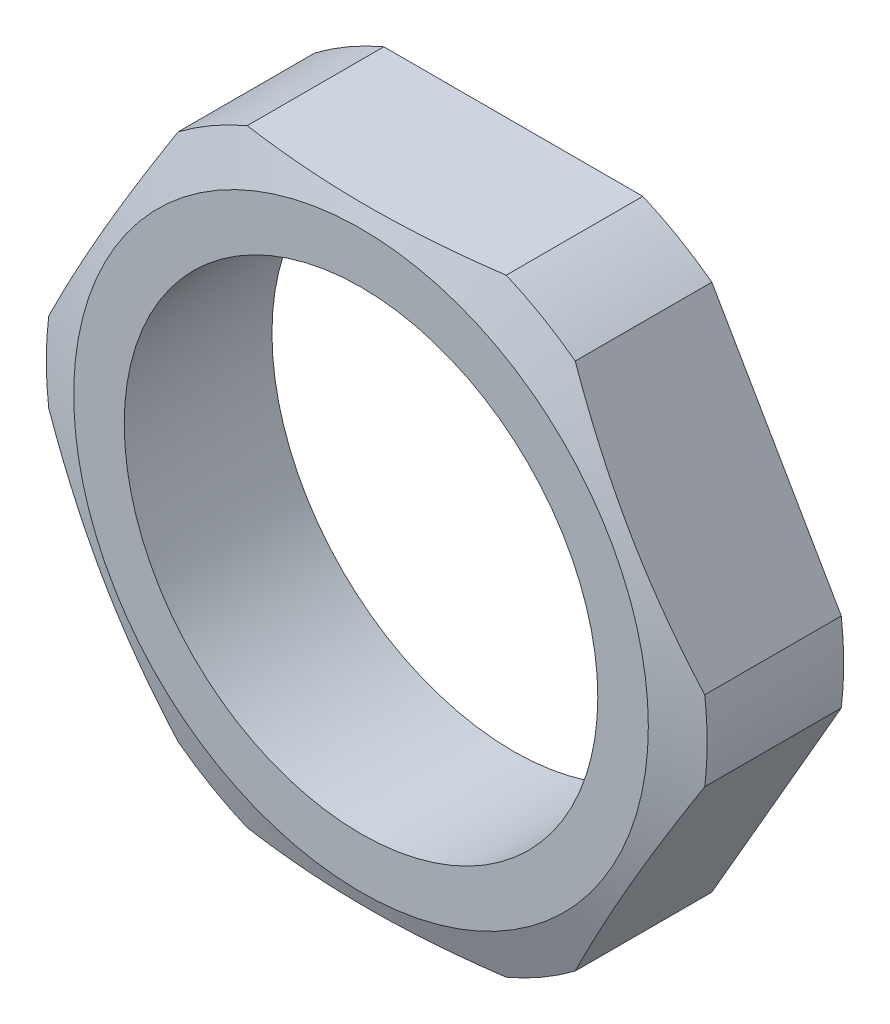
ISO-10303-21;
HEADER;
FILE_DESCRIPTION(('STEP AP214'),'2;1');
FILE_NAME('part.step','',(''),(''),'','','');
FILE_SCHEMA(('AUTOMOTIVE_DESIGN { 1 0 10303 214 1 1 1 1 }'));
ENDSEC;
DATA;
#1=APPLICATION_CONTEXT('core data for automotive mechanical design processes');
#2=APPLICATION_PROTOCOL_DEFINITION('international standard','automotive_design',2000,#1);
#3=PRODUCT_CONTEXT('',#1,'mechanical');
#4=PRODUCT('Part','Part','',(#3));
#5=PRODUCT_RELATED_PRODUCT_CATEGORY('part','',(#4));
#6=PRODUCT_DEFINITION_FORMATION('','',#4);
#7=PRODUCT_DEFINITION_CONTEXT('part definition',#1,'design');
#8=PRODUCT_DEFINITION('design','',#6,#7);
#9=PRODUCT_DEFINITION_SHAPE('','',#8);
#10=(LENGTH_UNIT() NAMED_UNIT(*) SI_UNIT(.MILLI.,.METRE.));
#11=(NAMED_UNIT(*) PLANE_ANGLE_UNIT() SI_UNIT($,.RADIAN.));
#12=(NAMED_UNIT(*) SI_UNIT($,.STERADIAN.) SOLID_ANGLE_UNIT());
#13=UNCERTAINTY_MEASURE_WITH_UNIT(LENGTH_MEASURE(1.E-05),#10,'distance_accuracy_value','');
#14=(GEOMETRIC_REPRESENTATION_CONTEXT(3) GLOBAL_UNCERTAINTY_ASSIGNED_CONTEXT((#13)) GLOBAL_UNIT_ASSIGNED_CONTEXT((#10,
#11,#12)) REPRESENTATION_CONTEXT('',''));
#15=CARTESIAN_POINT('',(0.,0.,0.));
#16=DIRECTION('',(0.,0.,1.));
#17=DIRECTION('',(1.,0.,0.));
#18=AXIS2_PLACEMENT_3D('',#15,#16,#17);
#19=CARTESIAN_POINT('',(7.75762462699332,-13.4366,3.3655));
#20=DIRECTION('',(-0.866025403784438,0.5,0.));
#21=DIRECTION('',(-0.5,-0.866025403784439,0.));
#22=AXIS2_PLACEMENT_3D('',#19,#20,#21);
#23=PLANE('',#22);
#24=DIRECTION('',(0.,0.,1.));
#25=VECTOR('',#24,1.);
#26=CARTESIAN_POINT('',(8.77445312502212,-11.6754013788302,-3.3655));
#27=LINE('',#26,#25);
#28=CARTESIAN_POINT('',(8.77445312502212,-11.6754013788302,-3.3655));
#29=VERTEX_POINT('',#28);
#30=CARTESIAN_POINT('',(8.77445312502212,-11.6754013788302,2.67213670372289));
#31=VERTEX_POINT('',#30);
#32=EDGE_CURVE('E188',#29,#31,#27,.T.);
#33=ORIENTED_EDGE('',*,*,#32,.F.);
#34=DIRECTION('',(0.5,0.866025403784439,0.));
#35=VECTOR('',#34,1.);
#36=CARTESIAN_POINT('',(7.75762462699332,-13.4366,-3.3655));
#37=LINE('',#36,#35);
#38=CARTESIAN_POINT('',(14.4984207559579,-1.76119862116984,-3.3655));
#39=VERTEX_POINT('',#38);
#40=EDGE_CURVE('E147',#29,#39,#37,.T.);
#41=ORIENTED_EDGE('',*,*,#40,.T.);
#42=DIRECTION('',(0.,0.,1.));
#43=VECTOR('',#42,1.);
#44=CARTESIAN_POINT('',(14.4984207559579,-1.76119862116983,-3.3655));
#45=LINE('',#44,#43);
#46=CARTESIAN_POINT('',(14.4984207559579,-1.76119862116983,2.67213670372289));
#47=VERTEX_POINT('',#46);
#48=EDGE_CURVE('E125',#47,#39,#45,.F.);
#49=ORIENTED_EDGE('',*,*,#48,.F.);
#50=CARTESIAN_POINT('',(7.75750915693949,-13.4368,2.34079104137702));
#51=CARTESIAN_POINT('',(8.07877898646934,-12.8803443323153,2.45776475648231));
#52=CARTESIAN_POINT('',(8.40110819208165,-12.3220537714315,2.5641723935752));
#53=CARTESIAN_POINT('',(9.04786232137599,-11.2018427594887,2.7513799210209));
#54=CARTESIAN_POINT('',(9.37228868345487,-10.6399198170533,2.83215977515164));
#55=CARTESIAN_POINT('',(10.0196369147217,-9.51867979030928,2.96281878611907));
#56=CARTESIAN_POINT('',(10.3425440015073,-8.95938830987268,3.0129829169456));
#57=CARTESIAN_POINT('',(10.9891132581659,-7.83949750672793,3.08026709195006));
#58=CARTESIAN_POINT('',(11.3127750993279,-7.27889875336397,3.09739952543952));
#59=CARTESIAN_POINT('',(11.960098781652,-6.15770124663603,3.09739952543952));
#60=CARTESIAN_POINT('',(12.2837606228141,-5.59710249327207,3.08026709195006));
#61=CARTESIAN_POINT('',(12.9303298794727,-4.47721169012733,3.0129829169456));
#62=CARTESIAN_POINT('',(13.2532369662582,-3.91792020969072,2.96281878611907));
#63=CARTESIAN_POINT('',(13.9005851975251,-2.79668018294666,2.83215977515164));
#64=CARTESIAN_POINT('',(14.225011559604,-2.2347572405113,2.7513799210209));
#65=CARTESIAN_POINT('',(14.8717656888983,-1.11454622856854,2.5641723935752));
#66=CARTESIAN_POINT('',(15.1940948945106,-0.556255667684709,2.45776475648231));
#67=CARTESIAN_POINT('',(15.5153647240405,0.000200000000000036,2.34079104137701));
#68=B_SPLINE_CURVE_WITH_KNOTS('',3,(#50,#51,#52,#53,#54,#55,#56,#57,#58,#59,#60,#61,#62,#63,#64,
#65,#66,#67),.UNSPECIFIED.,.F.,.F.,(4,2,2,2,2,2,2,2,4),(0.,1.95950312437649,3.92053446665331,
5.8630222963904,7.80478140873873,9.74654052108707,11.6890283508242,13.650059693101,
15.6095628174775),.UNSPECIFIED.);
#69=EDGE_CURVE('E182',#31,#47,#68,.T.);
#70=ORIENTED_EDGE('',*,*,#69,.F.);
#71=EDGE_LOOP('',(#33,#41,#49,#70));
#72=FACE_BOUND('',#71,.T.);
#73=ADVANCED_FACE('F31',(#72),#23,.F.);
#74=CARTESIAN_POINT('',(15.5152492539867,0.,3.3655));
#75=DIRECTION('',(-0.866025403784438,-0.5,0.));
#76=DIRECTION('',(0.5,-0.866025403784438,0.));
#77=AXIS2_PLACEMENT_3D('',#74,#75,#76);
#78=PLANE('',#77);
#79=DIRECTION('',(0.,0.,1.));
#80=VECTOR('',#79,1.);
#81=CARTESIAN_POINT('',(14.4984207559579,1.76119862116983,-3.3655));
#82=LINE('',#81,#80);
#83=CARTESIAN_POINT('',(14.4984207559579,1.76119862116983,-3.3655));
#84=VERTEX_POINT('',#83);
#85=CARTESIAN_POINT('',(14.4984207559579,1.76119862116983,2.67213670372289));
#86=VERTEX_POINT('',#85);
#87=EDGE_CURVE('E122',#84,#86,#82,.T.);
#88=ORIENTED_EDGE('',*,*,#87,.F.);
#89=DIRECTION('',(-0.5,0.866025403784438,0.));
#90=VECTOR('',#89,1.);
#91=CARTESIAN_POINT('',(15.5152492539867,0.,-3.3655));
#92=LINE('',#91,#90);
#93=CARTESIAN_POINT('',(8.77445312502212,11.6754013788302,-3.3655));
#94=VERTEX_POINT('',#93);
#95=EDGE_CURVE('E138',#84,#94,#92,.T.);
#96=ORIENTED_EDGE('',*,*,#95,.T.);
#97=DIRECTION('',(0.,0.,1.));
#98=VECTOR('',#97,1.);
#99=CARTESIAN_POINT('',(8.77445312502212,11.6754013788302,-3.3655));
#100=LINE('',#99,#98);
#101=CARTESIAN_POINT('',(8.77445312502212,11.6754013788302,2.67213670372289));
#102=VERTEX_POINT('',#101);
#103=EDGE_CURVE('E141',#102,#94,#100,.F.);
#104=ORIENTED_EDGE('',*,*,#103,.F.);
#105=CARTESIAN_POINT('',(15.5153647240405,-0.000199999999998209,2.34079104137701));
#106=CARTESIAN_POINT('',(15.1940948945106,0.556255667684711,2.45776475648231));
#107=CARTESIAN_POINT('',(14.8717656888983,1.11454622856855,2.56417239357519));
#108=CARTESIAN_POINT('',(14.225011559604,2.2347572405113,2.7513799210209));
#109=CARTESIAN_POINT('',(13.9005851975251,2.79668018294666,2.83215977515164));
#110=CARTESIAN_POINT('',(13.2532369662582,3.91792020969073,2.96281878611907));
#111=CARTESIAN_POINT('',(12.9303298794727,4.47721169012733,3.0129829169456));
#112=CARTESIAN_POINT('',(12.2837606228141,5.59710249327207,3.08026709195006));
#113=CARTESIAN_POINT('',(11.960098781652,6.15770124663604,3.09739952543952));
#114=CARTESIAN_POINT('',(11.3127750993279,7.27889875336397,3.09739952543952));
#115=CARTESIAN_POINT('',(10.9891132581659,7.83949750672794,3.08026709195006));
#116=CARTESIAN_POINT('',(10.3425440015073,8.95938830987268,3.0129829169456));
#117=CARTESIAN_POINT('',(10.0196369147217,9.51867979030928,2.96281878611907));
#118=CARTESIAN_POINT('',(9.37228868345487,10.6399198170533,2.83215977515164));
#119=CARTESIAN_POINT('',(9.04786232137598,11.2018427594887,2.7513799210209));
#120=CARTESIAN_POINT('',(8.40110819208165,12.3220537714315,2.5641723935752));
#121=CARTESIAN_POINT('',(8.07877898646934,12.8803443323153,2.45776475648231));
#122=CARTESIAN_POINT('',(7.75750915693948,13.4368,2.34079104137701));
#123=B_SPLINE_CURVE_WITH_KNOTS('',3,(#105,#106,#107,#108,#109,#110,#111,#112,#113,#114,#115,
#116,#117,#118,#119,#120,#121,#122),.UNSPECIFIED.,.F.,.F.,(4,2,2,2,2,2,2,2,4),(0.,
1.95950312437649,3.92053446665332,5.8630222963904,7.80478140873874,9.74654052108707,
11.6890283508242,13.650059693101,15.6095628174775),.UNSPECIFIED.);
#124=EDGE_CURVE('E140',#86,#102,#123,.T.);
#125=ORIENTED_EDGE('',*,*,#124,.F.);
#126=EDGE_LOOP('',(#88,#96,#104,#125));
#127=FACE_BOUND('',#126,.T.);
#128=ADVANCED_FACE('F136',(#127),#78,.F.);
#129=CARTESIAN_POINT('',(7.75762462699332,13.4366,3.3655));
#130=DIRECTION('',(0.,-1.,0.));
#131=DIRECTION('',(1.,0.,0.));
#132=AXIS2_PLACEMENT_3D('',#129,#130,#131);
#133=PLANE('',#132);
#134=DIRECTION('',(0.,0.,1.));
#135=VECTOR('',#134,1.);
#136=CARTESIAN_POINT('',(5.72396763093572,13.4366,-3.3655));
#137=LINE('',#136,#135);
#138=CARTESIAN_POINT('',(5.72396763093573,13.4366,-3.3655));
#139=VERTEX_POINT('',#138);
#140=CARTESIAN_POINT('',(5.72396763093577,13.4366,2.67213670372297));
#141=VERTEX_POINT('',#140);
#142=EDGE_CURVE('E378',#139,#141,#137,.T.);
#143=ORIENTED_EDGE('',*,*,#142,.F.);
#144=DIRECTION('',(-1.,0.,0.));
#145=VECTOR('',#144,1.);
#146=CARTESIAN_POINT('',(7.75762462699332,13.4366,-3.3655));
#147=LINE('',#146,#145);
#148=CARTESIAN_POINT('',(-5.72396763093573,13.4366,-3.3655));
#149=VERTEX_POINT('',#148);
#150=EDGE_CURVE('E146',#139,#149,#147,.T.);
#151=ORIENTED_EDGE('',*,*,#150,.T.);
#152=DIRECTION('',(0.,0.,1.));
#153=VECTOR('',#152,1.);
#154=CARTESIAN_POINT('',(-5.72396763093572,13.4366,-3.3655));
#155=LINE('',#154,#153);
#156=CARTESIAN_POINT('',(-5.72396763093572,13.4366,2.67213670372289));
#157=VERTEX_POINT('',#156);
#158=EDGE_CURVE('E376',#157,#149,#155,.F.);
#159=ORIENTED_EDGE('',*,*,#158,.F.);
#160=CARTESIAN_POINT('',(-20.737507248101,13.4366,-1.00579964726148));
#161=CARTESIAN_POINT('',(-20.432218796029,13.4366,-0.912549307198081));
#162=CARTESIAN_POINT('',(-20.1267614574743,13.4366,-0.819852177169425));
#163=CARTESIAN_POINT('',(-19.5154743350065,13.4366,-0.635688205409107));
#164=CARTESIAN_POINT('',(-19.2096445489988,13.4366,-0.544221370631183));
#165=CARTESIAN_POINT('',(-18.2915057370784,13.4366,-0.27184064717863));
#166=CARTESIAN_POINT('',(-17.6785910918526,13.4366,-0.0929599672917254));
#167=CARTESIAN_POINT('',(-16.4497777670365,13.4366,0.25843615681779));
#168=CARTESIAN_POINT('',(-15.8338757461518,13.4366,0.430939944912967));
#169=CARTESIAN_POINT('',(-14.5998056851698,13.4366,0.767632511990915));
#170=CARTESIAN_POINT('',(-13.9816376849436,13.4366,0.931821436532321));
#171=CARTESIAN_POINT('',(-12.7511051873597,13.4366,1.24763783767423));
#172=CARTESIAN_POINT('',(-12.1387771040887,13.4366,1.39940651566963));
#173=CARTESIAN_POINT('',(-10.9110984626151,13.4366,1.6903199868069));
#174=CARTESIAN_POINT('',(-10.2957478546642,13.4366,1.82946457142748));
#175=CARTESIAN_POINT('',(-9.06182828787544,13.4366,2.09195868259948));
#176=CARTESIAN_POINT('',(-8.44326022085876,13.4366,2.21531236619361));
#177=CARTESIAN_POINT('',(-7.2025266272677,13.4366,2.4425230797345));
#178=CARTESIAN_POINT('',(-6.58036121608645,13.4366,2.54638073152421));
#179=CARTESIAN_POINT('',(-5.40190078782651,13.4366,2.72020324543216));
#180=CARTESIAN_POINT('',(-4.84597573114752,13.4366,2.79265294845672));
#181=CARTESIAN_POINT('',(-3.73171668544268,13.4366,2.91596753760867));
#182=CARTESIAN_POINT('',(-3.17338276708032,13.4366,2.96683305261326));
#183=CARTESIAN_POINT('',(-2.05547031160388,13.4366,3.04453362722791));
#184=CARTESIAN_POINT('',(-1.49589314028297,13.4366,3.0713880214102));
#185=CARTESIAN_POINT('',(-0.376089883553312,13.4366,3.09970851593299));
#186=CARTESIAN_POINT('',(0.184136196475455,13.4366,3.10117482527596));
#187=CARTESIAN_POINT('',(1.30754192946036,13.4366,3.07856751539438));
#188=CARTESIAN_POINT('',(1.87071834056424,13.4366,3.05433537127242));
#189=CARTESIAN_POINT('',(2.99547115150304,13.4366,2.98139766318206));
#190=CARTESIAN_POINT('',(3.55704750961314,13.4366,2.9326914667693));
#191=CARTESIAN_POINT('',(4.67833814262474,13.4366,2.81312524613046));
#192=CARTESIAN_POINT('',(5.23805016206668,13.4366,2.7422443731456));
#193=CARTESIAN_POINT('',(6.35466094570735,13.4366,2.58126693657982));
#194=CARTESIAN_POINT('',(6.91155973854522,13.4366,2.4911705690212));
#195=CARTESIAN_POINT('',(8.17246287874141,13.4366,2.26825128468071));
#196=CARTESIAN_POINT('',(8.87558332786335,13.4366,2.13046039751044));
#197=CARTESIAN_POINT('',(10.2775126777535,13.4366,1.8343108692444));
#198=CARTESIAN_POINT('',(10.9763210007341,13.4366,1.67594953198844));
#199=CARTESIAN_POINT('',(12.3704350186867,13.4366,1.34316806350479));
#200=CARTESIAN_POINT('',(13.0657388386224,13.4366,1.16874013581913));
#201=CARTESIAN_POINT('',(14.4530622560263,13.4366,0.807475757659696));
#202=CARTESIAN_POINT('',(15.1450819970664,13.4366,0.620639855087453));
#203=CARTESIAN_POINT('',(16.5277773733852,13.4366,0.236900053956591));
#204=CARTESIAN_POINT('',(17.2184476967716,13.4366,0.0399770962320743));
#205=CARTESIAN_POINT('',(18.5975571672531,13.4366,-0.36152815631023));
#206=CARTESIAN_POINT('',(19.2859962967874,13.4366,-0.566110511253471));
#207=CARTESIAN_POINT('',(20.6608381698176,13.4366,-0.981307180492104));
#208=CARTESIAN_POINT('',(21.3472414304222,13.4366,-1.19191978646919));
#209=CARTESIAN_POINT('',(22.7185219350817,13.4366,-1.61803862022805));
#210=CARTESIAN_POINT('',(23.4033991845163,13.4366,-1.83354483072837));
#211=CARTESIAN_POINT('',(24.7604858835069,13.4366,-2.26490988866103));
#212=CARTESIAN_POINT('',(25.4327162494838,13.4366,-2.48070301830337));
#213=CARTESIAN_POINT('',(26.7761503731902,13.4366,-2.91546358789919));
#214=CARTESIAN_POINT('',(27.4473541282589,13.4366,-3.13443103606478));
#215=CARTESIAN_POINT('',(29.4597782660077,13.4366,-3.79529816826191));
#216=CARTESIAN_POINT('',(30.7997078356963,13.4366,-4.24112948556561));
#217=CARTESIAN_POINT('',(32.8043764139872,13.4366,-4.91431891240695));
#218=CARTESIAN_POINT('',(33.4700574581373,13.4366,-5.13888439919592));
#219=CARTESIAN_POINT('',(34.8008828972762,13.4366,-5.58960223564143));
#220=CARTESIAN_POINT('',(35.4660272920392,13.4366,-5.81575458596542));
#221=CARTESIAN_POINT('',(36.7957804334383,13.4366,-6.26939177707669));
#222=CARTESIAN_POINT('',(37.4603892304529,13.4366,-6.49687647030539));
#223=CARTESIAN_POINT('',(38.7892002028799,13.4366,-6.95302659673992));
#224=CARTESIAN_POINT('',(39.453402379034,13.4366,-7.18169202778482));
#225=CARTESIAN_POINT('',(40.1174307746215,13.4366,-7.41086018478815));
#226=B_SPLINE_CURVE_WITH_KNOTS('',3,(#160,#161,#162,#163,#164,#165,#166,#167,#168,#169,#170,
#171,#172,#173,#174,#175,#176,#177,#178,#179,#180,#181,#182,#183,#184,#185,#186,#187,#188,#189,
#190,#191,#192,#193,#194,#195,#196,#197,#198,#199,#200,#201,#202,#203,#204,#205,#206,#207,#208,
#209,#210,#211,#212,#213,#214,#215,#216,#217,#218,#219,#220,#221,#222,#223,#224,#225),
.UNSPECIFIED.,.F.,.F.,(4,2,2,2,2,2,2,2,2,2,2,2,2,2,2,2,2,2,2,2,2,2,2,2,2,2,2,2,2,2,2,2,4),(0.,
0.957636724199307,1.91527885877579,3.83070065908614,5.7494659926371,7.66819772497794,
9.56066039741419,11.4531543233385,13.345149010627,15.2370833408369,16.9185980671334,
18.6000637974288,20.2801743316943,21.9602710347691,23.6507922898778,25.3413572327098,
27.0335164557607,28.7256584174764,30.8747280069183,33.0240795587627,35.1744796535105,
37.3247848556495,39.4793147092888,41.6338614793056,43.7878038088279,45.9417385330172,
48.0597807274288,50.1778284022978,54.4142503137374,56.5218662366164,58.6294830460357,
60.7368706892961,62.8442544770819),.UNSPECIFIED.);
#227=EDGE_CURVE('E193',#141,#157,#226,.F.);
#228=ORIENTED_EDGE('',*,*,#227,.F.);
#229=EDGE_LOOP('',(#143,#151,#159,#228));
#230=FACE_BOUND('',#229,.T.);
#231=ADVANCED_FACE('F239',(#230),#133,.F.);
#232=CARTESIAN_POINT('',(-7.75762462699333,13.4366,3.3655));
#233=DIRECTION('',(0.866025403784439,-0.5,0.));
#234=DIRECTION('',(0.5,0.866025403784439,0.));
#235=AXIS2_PLACEMENT_3D('',#232,#233,#234);
#236=PLANE('',#235);
#237=DIRECTION('',(0.,0.,1.));
#238=VECTOR('',#237,1.);
#239=CARTESIAN_POINT('',(-8.77445312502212,11.6754013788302,-3.3655));
#240=LINE('',#239,#238);
#241=CARTESIAN_POINT('',(-8.77445312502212,11.6754013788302,-3.3655));
#242=VERTEX_POINT('',#241);
#243=CARTESIAN_POINT('',(-8.77445312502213,11.6754013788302,2.67213670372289));
#244=VERTEX_POINT('',#243);
#245=EDGE_CURVE('E371',#242,#244,#240,.T.);
#246=ORIENTED_EDGE('',*,*,#245,.F.);
#247=DIRECTION('',(-0.5,-0.866025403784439,0.));
#248=VECTOR('',#247,1.);
#249=CARTESIAN_POINT('',(-7.75762462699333,13.4366,-3.3655));
#250=LINE('',#249,#248);
#251=CARTESIAN_POINT('',(-14.4984207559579,1.76119862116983,-3.3655));
#252=VERTEX_POINT('',#251);
#253=EDGE_CURVE('E150',#242,#252,#250,.T.);
#254=ORIENTED_EDGE('',*,*,#253,.T.);
#255=DIRECTION('',(0.,0.,1.));
#256=VECTOR('',#255,1.);
#257=CARTESIAN_POINT('',(-14.4984207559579,1.76119862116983,-3.3655));
#258=LINE('',#257,#256);
#259=CARTESIAN_POINT('',(-14.4984207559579,1.76119862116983,2.67213670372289));
#260=VERTEX_POINT('',#259);
#261=EDGE_CURVE('E369',#260,#252,#258,.F.);
#262=ORIENTED_EDGE('',*,*,#261,.F.);
#263=CARTESIAN_POINT('',(-7.75750915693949,13.4368,2.34079104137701));
#264=CARTESIAN_POINT('',(-8.07877898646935,12.8803443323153,2.45776475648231));
#265=CARTESIAN_POINT('',(-8.40110819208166,12.3220537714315,2.5641723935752));
#266=CARTESIAN_POINT('',(-9.04786232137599,11.2018427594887,2.7513799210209));
#267=CARTESIAN_POINT('',(-9.37228868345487,10.6399198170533,2.83215977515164));
#268=CARTESIAN_POINT('',(-10.0196369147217,9.51867979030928,2.96281878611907));
#269=CARTESIAN_POINT('',(-10.3425440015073,8.95938830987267,3.0129829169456));
#270=CARTESIAN_POINT('',(-10.9891132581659,7.83949750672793,3.08026709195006));
#271=CARTESIAN_POINT('',(-11.3127750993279,7.27889875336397,3.09739952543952));
#272=CARTESIAN_POINT('',(-11.960098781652,6.15770124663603,3.09739952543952));
#273=CARTESIAN_POINT('',(-12.2837606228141,5.59710249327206,3.08026709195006));
#274=CARTESIAN_POINT('',(-12.9303298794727,4.47721169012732,3.0129829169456));
#275=CARTESIAN_POINT('',(-13.2532369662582,3.91792020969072,2.96281878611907));
#276=CARTESIAN_POINT('',(-13.9005851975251,2.79668018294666,2.83215977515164));
#277=CARTESIAN_POINT('',(-14.225011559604,2.23475724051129,2.7513799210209));
#278=CARTESIAN_POINT('',(-14.8717656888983,1.11454622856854,2.56417239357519));
#279=CARTESIAN_POINT('',(-15.1940948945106,0.5562556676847,2.45776475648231));
#280=CARTESIAN_POINT('',(-15.5153647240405,-0.000200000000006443,2.34079104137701));
#281=B_SPLINE_CURVE_WITH_KNOTS('',3,(#263,#264,#265,#266,#267,#268,#269,#270,#271,#272,#273,
#274,#275,#276,#277,#278,#279,#280),.UNSPECIFIED.,.F.,.F.,(4,2,2,2,2,2,2,2,4),(0.,
1.95950312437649,3.92053446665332,5.8630222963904,7.80478140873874,9.74654052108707,
11.6890283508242,13.650059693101,15.6095628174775),.UNSPECIFIED.);
#282=EDGE_CURVE('E230',#244,#260,#281,.T.);
#283=ORIENTED_EDGE('',*,*,#282,.F.);
#284=EDGE_LOOP('',(#246,#254,#262,#283));
#285=FACE_BOUND('',#284,.T.);
#286=ADVANCED_FACE('F242',(#285),#236,.F.);
#287=CARTESIAN_POINT('',(-15.5152492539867,0.,3.3655));
#288=DIRECTION('',(0.866025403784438,0.5,0.));
#289=DIRECTION('',(-0.5,0.866025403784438,0.));
#290=AXIS2_PLACEMENT_3D('',#287,#288,#289);
#291=PLANE('',#290);
#292=DIRECTION('',(0.,0.,1.));
#293=VECTOR('',#292,1.);
#294=CARTESIAN_POINT('',(-14.4984207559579,-1.76119862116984,-3.3655));
#295=LINE('',#294,#293);
#296=CARTESIAN_POINT('',(-14.4984207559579,-1.76119862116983,-3.3655));
#297=VERTEX_POINT('',#296);
#298=CARTESIAN_POINT('',(-14.4984207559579,-1.76119862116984,2.67213670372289));
#299=VERTEX_POINT('',#298);
#300=EDGE_CURVE('E54',#297,#299,#295,.T.);
#301=ORIENTED_EDGE('',*,*,#300,.F.);
#302=DIRECTION('',(0.5,-0.866025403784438,0.));
#303=VECTOR('',#302,1.);
#304=CARTESIAN_POINT('',(-15.5152492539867,0.,-3.3655));
#305=LINE('',#304,#303);
#306=CARTESIAN_POINT('',(-8.77445312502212,-11.6754013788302,-3.3655));
#307=VERTEX_POINT('',#306);
#308=EDGE_CURVE('E158',#297,#307,#305,.T.);
#309=ORIENTED_EDGE('',*,*,#308,.T.);
#310=DIRECTION('',(0.,0.,1.));
#311=VECTOR('',#310,1.);
#312=CARTESIAN_POINT('',(-8.77445312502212,-11.6754013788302,-3.3655));
#313=LINE('',#312,#311);
#314=CARTESIAN_POINT('',(-8.77445312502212,-11.6754013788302,2.67213670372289));
#315=VERTEX_POINT('',#314);
#316=EDGE_CURVE('E360',#315,#307,#313,.F.);
#317=ORIENTED_EDGE('',*,*,#316,.F.);
#318=CARTESIAN_POINT('',(-15.5153647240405,0.000199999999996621,2.34079104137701));
#319=CARTESIAN_POINT('',(-15.1940948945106,-0.556255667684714,2.45776475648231));
#320=CARTESIAN_POINT('',(-14.8717656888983,-1.11454622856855,2.56417239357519));
#321=CARTESIAN_POINT('',(-14.225011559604,-2.2347572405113,2.7513799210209));
#322=CARTESIAN_POINT('',(-13.9005851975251,-2.79668018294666,2.83215977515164));
#323=CARTESIAN_POINT('',(-13.2532369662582,-3.91792020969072,2.96281878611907));
#324=CARTESIAN_POINT('',(-12.9303298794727,-4.47721169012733,3.0129829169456));
#325=CARTESIAN_POINT('',(-12.2837606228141,-5.59710249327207,3.08026709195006));
#326=CARTESIAN_POINT('',(-11.960098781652,-6.15770124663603,3.09739952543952));
#327=CARTESIAN_POINT('',(-11.3127750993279,-7.27889875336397,3.09739952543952));
#328=CARTESIAN_POINT('',(-10.9891132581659,-7.83949750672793,3.08026709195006));
#329=CARTESIAN_POINT('',(-10.3425440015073,-8.95938830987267,3.0129829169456));
#330=CARTESIAN_POINT('',(-10.0196369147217,-9.51867979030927,2.96281878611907));
#331=CARTESIAN_POINT('',(-9.37228868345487,-10.6399198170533,2.83215977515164));
#332=CARTESIAN_POINT('',(-9.04786232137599,-11.2018427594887,2.75137992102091));
#333=CARTESIAN_POINT('',(-8.40110819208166,-12.3220537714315,2.5641723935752));
#334=CARTESIAN_POINT('',(-8.07877898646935,-12.8803443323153,2.45776475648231));
#335=CARTESIAN_POINT('',(-7.75750915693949,-13.4368,2.34079104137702));
#336=B_SPLINE_CURVE_WITH_KNOTS('',3,(#318,#319,#320,#321,#322,#323,#324,#325,#326,#327,#328,
#329,#330,#331,#332,#333,#334,#335),.UNSPECIFIED.,.F.,.F.,(4,2,2,2,2,2,2,2,4),(0.,
1.95950312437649,3.92053446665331,5.86302229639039,7.80478140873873,9.74654052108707,
11.6890283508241,13.650059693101,15.6095628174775),.UNSPECIFIED.);
#337=EDGE_CURVE('E224',#299,#315,#336,.T.);
#338=ORIENTED_EDGE('',*,*,#337,.F.);
#339=EDGE_LOOP('',(#301,#309,#317,#338));
#340=FACE_BOUND('',#339,.T.);
#341=ADVANCED_FACE('F277',(#340),#291,.F.);
#342=CARTESIAN_POINT('',(-7.75762462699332,-13.4366,3.3655));
#343=DIRECTION('',(0.,1.,0.));
#344=DIRECTION('',(0.,0.,1.));
#345=AXIS2_PLACEMENT_3D('',#342,#343,#344);
#346=PLANE('',#345);
#347=DIRECTION('',(0.,0.,1.));
#348=VECTOR('',#347,1.);
#349=CARTESIAN_POINT('',(-5.72396763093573,-13.4366,-3.3655));
#350=LINE('',#349,#348);
#351=CARTESIAN_POINT('',(-5.72396763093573,-13.4366,-3.3655));
#352=VERTEX_POINT('',#351);
#353=CARTESIAN_POINT('',(-5.72396763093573,-13.4366,2.67213670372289));
#354=VERTEX_POINT('',#353);
#355=EDGE_CURVE('E47',#352,#354,#350,.T.);
#356=ORIENTED_EDGE('',*,*,#355,.F.);
#357=DIRECTION('',(1.,0.,0.));
#358=VECTOR('',#357,1.);
#359=CARTESIAN_POINT('',(-7.75762462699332,-13.4366,-3.3655));
#360=LINE('',#359,#358);
#361=CARTESIAN_POINT('',(5.72396763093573,-13.4366,-3.3655));
#362=VERTEX_POINT('',#361);
#363=EDGE_CURVE('E160',#352,#362,#360,.T.);
#364=ORIENTED_EDGE('',*,*,#363,.T.);
#365=DIRECTION('',(0.,0.,1.));
#366=VECTOR('',#365,1.);
#367=CARTESIAN_POINT('',(5.72396763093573,-13.4366,-3.3655));
#368=LINE('',#367,#366);
#369=CARTESIAN_POINT('',(5.72396763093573,-13.4366,2.67213670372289));
#370=VERTEX_POINT('',#369);
#371=EDGE_CURVE('E382',#370,#362,#368,.F.);
#372=ORIENTED_EDGE('',*,*,#371,.F.);
#373=CARTESIAN_POINT('',(-20.737507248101,-13.4366,-1.00579964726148));
#374=CARTESIAN_POINT('',(-20.432218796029,-13.4366,-0.912549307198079));
#375=CARTESIAN_POINT('',(-20.1267614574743,-13.4366,-0.819852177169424));
#376=CARTESIAN_POINT('',(-19.5154743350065,-13.4366,-0.635688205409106));
#377=CARTESIAN_POINT('',(-19.2096445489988,-13.4366,-0.544221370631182));
#378=CARTESIAN_POINT('',(-18.2915057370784,-13.4366,-0.271840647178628));
#379=CARTESIAN_POINT('',(-17.6785910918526,-13.4366,-0.092959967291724));
#380=CARTESIAN_POINT('',(-16.4497777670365,-13.4366,0.258436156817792));
#381=CARTESIAN_POINT('',(-15.8338757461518,-13.4366,0.43093994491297));
#382=CARTESIAN_POINT('',(-14.5998056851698,-13.4366,0.767632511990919));
#383=CARTESIAN_POINT('',(-13.9816376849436,-13.4366,0.931821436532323));
#384=CARTESIAN_POINT('',(-12.7511051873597,-13.4366,1.24763783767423));
#385=CARTESIAN_POINT('',(-12.1387771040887,-13.4366,1.39940651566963));
#386=CARTESIAN_POINT('',(-10.9110984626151,-13.4366,1.69031998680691));
#387=CARTESIAN_POINT('',(-10.2957478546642,-13.4366,1.82946457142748));
#388=CARTESIAN_POINT('',(-9.06182828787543,-13.4366,2.09195868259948));
#389=CARTESIAN_POINT('',(-8.44326022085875,-13.4366,2.21531236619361));
#390=CARTESIAN_POINT('',(-7.2025266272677,-13.4366,2.4425230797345));
#391=CARTESIAN_POINT('',(-6.58036121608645,-13.4366,2.54638073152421));
#392=CARTESIAN_POINT('',(-5.40190078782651,-13.4366,2.72020324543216));
#393=CARTESIAN_POINT('',(-4.84597573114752,-13.4366,2.79265294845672));
#394=CARTESIAN_POINT('',(-3.73171668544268,-13.4366,2.91596753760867));
#395=CARTESIAN_POINT('',(-3.17338276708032,-13.4366,2.96683305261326));
#396=CARTESIAN_POINT('',(-2.05547031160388,-13.4366,3.04453362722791));
#397=CARTESIAN_POINT('',(-1.49589314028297,-13.4366,3.0713880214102));
#398=CARTESIAN_POINT('',(-0.376089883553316,-13.4366,3.09970851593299));
#399=CARTESIAN_POINT('',(0.184136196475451,-13.4366,3.10117482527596));
#400=CARTESIAN_POINT('',(1.30754192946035,-13.4366,3.07856751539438));
#401=CARTESIAN_POINT('',(1.87071834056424,-13.4366,3.05433537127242));
#402=CARTESIAN_POINT('',(2.99547115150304,-13.4366,2.98139766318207));
#403=CARTESIAN_POINT('',(3.55704750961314,-13.4366,2.9326914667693));
#404=CARTESIAN_POINT('',(4.67833814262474,-13.4366,2.81312524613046));
#405=CARTESIAN_POINT('',(5.23805016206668,-13.4366,2.7422443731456));
#406=CARTESIAN_POINT('',(6.35466094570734,-13.4366,2.58126693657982));
#407=CARTESIAN_POINT('',(6.91155973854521,-13.4366,2.49117056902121));
#408=CARTESIAN_POINT('',(8.1724628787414,-13.4366,2.26825128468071));
#409=CARTESIAN_POINT('',(8.87558332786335,-13.4366,2.13046039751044));
#410=CARTESIAN_POINT('',(10.2775126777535,-13.4366,1.8343108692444));
#411=CARTESIAN_POINT('',(10.9763210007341,-13.4366,1.67594953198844));
#412=CARTESIAN_POINT('',(12.3704350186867,-13.4366,1.34316806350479));
#413=CARTESIAN_POINT('',(13.0657388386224,-13.4366,1.16874013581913));
#414=CARTESIAN_POINT('',(14.4530622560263,-13.4366,0.807475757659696));
#415=CARTESIAN_POINT('',(15.1450819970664,-13.4366,0.620639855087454));
#416=CARTESIAN_POINT('',(16.5277773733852,-13.4366,0.236900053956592));
#417=CARTESIAN_POINT('',(17.2184476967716,-13.4366,0.0399770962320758));
#418=CARTESIAN_POINT('',(18.5975571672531,-13.4366,-0.361528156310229));
#419=CARTESIAN_POINT('',(19.2859962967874,-13.4366,-0.566110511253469));
#420=CARTESIAN_POINT('',(20.6608381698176,-13.4366,-0.981307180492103));
#421=CARTESIAN_POINT('',(21.3472414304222,-13.4366,-1.19191978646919));
#422=CARTESIAN_POINT('',(22.7185219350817,-13.4366,-1.61803862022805));
#423=CARTESIAN_POINT('',(23.4033991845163,-13.4366,-1.83354483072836));
#424=CARTESIAN_POINT('',(24.7604858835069,-13.4366,-2.26490988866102));
#425=CARTESIAN_POINT('',(25.4327162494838,-13.4366,-2.48070301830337));
#426=CARTESIAN_POINT('',(26.7761503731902,-13.4366,-2.91546358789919));
#427=CARTESIAN_POINT('',(27.4473541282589,-13.4366,-3.13443103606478));
#428=CARTESIAN_POINT('',(29.4597782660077,-13.4366,-3.79529816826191));
#429=CARTESIAN_POINT('',(30.7997078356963,-13.4366,-4.2411294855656));
#430=CARTESIAN_POINT('',(32.8043764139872,-13.4366,-4.91431891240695));
#431=CARTESIAN_POINT('',(33.4700574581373,-13.4366,-5.13888439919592));
#432=CARTESIAN_POINT('',(34.8008828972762,-13.4366,-5.58960223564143));
#433=CARTESIAN_POINT('',(35.4660272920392,-13.4366,-5.81575458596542));
#434=CARTESIAN_POINT('',(36.7957804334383,-13.4366,-6.26939177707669));
#435=CARTESIAN_POINT('',(37.4603892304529,-13.4366,-6.49687647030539));
#436=CARTESIAN_POINT('',(38.7892002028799,-13.4366,-6.95302659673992));
#437=CARTESIAN_POINT('',(39.453402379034,-13.4366,-7.18169202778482));
#438=CARTESIAN_POINT('',(40.1174307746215,-13.4366,-7.41086018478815));
#439=B_SPLINE_CURVE_WITH_KNOTS('',3,(#373,#374,#375,#376,#377,#378,#379,#380,#381,#382,#383,
#384,#385,#386,#387,#388,#389,#390,#391,#392,#393,#394,#395,#396,#397,#398,#399,#400,#401,#402,
#403,#404,#405,#406,#407,#408,#409,#410,#411,#412,#413,#414,#415,#416,#417,#418,#419,#420,#421,
#422,#423,#424,#425,#426,#427,#428,#429,#430,#431,#432,#433,#434,#435,#436,#437,#438),
.UNSPECIFIED.,.F.,.F.,(4,2,2,2,2,2,2,2,2,2,2,2,2,2,2,2,2,2,2,2,2,2,2,2,2,2,2,2,2,2,2,2,4),(0.,
0.957636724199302,1.91527885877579,3.83070065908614,5.7494659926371,7.66819772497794,
9.56066039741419,11.4531543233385,13.345149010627,15.2370833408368,16.9185980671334,
18.6000637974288,20.2801743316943,21.9602710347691,23.6507922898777,25.3413572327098,
27.0335164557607,28.7256584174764,30.8747280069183,33.0240795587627,35.1744796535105,
37.3247848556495,39.4793147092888,41.6338614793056,43.7878038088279,45.9417385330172,
48.0597807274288,50.1778284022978,54.4142503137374,56.5218662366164,58.6294830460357,
60.7368706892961,62.8442544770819),.UNSPECIFIED.);
#440=EDGE_CURVE('E184',#354,#370,#439,.T.);
#441=ORIENTED_EDGE('',*,*,#440,.F.);
#442=EDGE_LOOP('',(#356,#364,#372,#441));
#443=FACE_BOUND('',#442,.T.);
#444=ADVANCED_FACE('F286',(#443),#346,.F.);
#445=CARTESIAN_POINT('',(15.5152492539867,0.,-3.3655));
#446=DIRECTION('',(0.,0.,1.));
#447=DIRECTION('',(1.,0.,0.));
#448=AXIS2_PLACEMENT_3D('',#445,#446,#447);
#449=PLANE('',#448);
#450=CARTESIAN_POINT('',(0.,0.,-3.3655));
#451=DIRECTION('',(0.,0.,-1.));
#452=DIRECTION('',(-1.,0.,0.));
#453=AXIS2_PLACEMENT_3D('',#450,#451,#452);
#454=CIRCLE('',#453,10.668);
#455=CARTESIAN_POINT('',(-10.668,0.,-3.3655));
#456=VERTEX_POINT('',#455);
#457=EDGE_CURVE('E189',#456,#456,#454,.T.);
#458=ORIENTED_EDGE('',*,*,#457,.F.);
#459=EDGE_LOOP('',(#458));
#460=FACE_BOUND('',#459,.T.);
#461=CARTESIAN_POINT('',(0.,0.,-3.3655));
#462=DIRECTION('',(0.,0.,1.));
#463=DIRECTION('',(1.,0.,0.));
#464=AXIS2_PLACEMENT_3D('',#461,#462,#463);
#465=CIRCLE('',#464,14.605);
#466=EDGE_CURVE('E132',#94,#139,#465,.T.);
#467=ORIENTED_EDGE('',*,*,#466,.F.);
#468=ORIENTED_EDGE('',*,*,#95,.F.);
#469=EDGE_CURVE('E119',#39,#84,#465,.T.);
#470=ORIENTED_EDGE('',*,*,#469,.F.);
#471=ORIENTED_EDGE('',*,*,#40,.F.);
#472=EDGE_CURVE('E130',#362,#29,#465,.T.);
#473=ORIENTED_EDGE('',*,*,#472,.F.);
#474=ORIENTED_EDGE('',*,*,#363,.F.);
#475=EDGE_CURVE('E362',#307,#352,#465,.T.);
#476=ORIENTED_EDGE('',*,*,#475,.F.);
#477=ORIENTED_EDGE('',*,*,#308,.F.);
#478=EDGE_CURVE('E368',#252,#297,#465,.T.);
#479=ORIENTED_EDGE('',*,*,#478,.F.);
#480=ORIENTED_EDGE('',*,*,#253,.F.);
#481=EDGE_CURVE('E373',#149,#242,#465,.T.);
#482=ORIENTED_EDGE('',*,*,#481,.F.);
#483=ORIENTED_EDGE('',*,*,#150,.F.);
#484=EDGE_LOOP('',(#467,#468,#470,#471,#473,#474,#476,#477,#479,#480,#482,#483));
#485=FACE_BOUND('',#484,.T.);
#486=ADVANCED_FACE('F144',(#460,#485),#449,.F.);
#487=CARTESIAN_POINT('',(0.,0.,3.3655));
#488=DIRECTION('',(0.,0.,-1.));
#489=DIRECTION('',(1.,0.,0.));
#490=AXIS2_PLACEMENT_3D('',#487,#488,#489);
#491=CONICAL_SURFACE('',#490,12.7,1.22173047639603);
#492=CARTESIAN_POINT('',(0.,0.,3.3655));
#493=DIRECTION('',(0.,0.,1.));
#494=DIRECTION('',(1.,0.,0.));
#495=AXIS2_PLACEMENT_3D('',#492,#493,#494);
#496=CIRCLE('',#495,12.7);
#497=CARTESIAN_POINT('',(12.7,0.,3.3655));
#498=VERTEX_POINT('',#497);
#499=EDGE_CURVE('E363',#498,#498,#496,.T.);
#500=ORIENTED_EDGE('',*,*,#499,.F.);
#501=EDGE_LOOP('',(#500));
#502=FACE_BOUND('',#501,.T.);
#503=ORIENTED_EDGE('',*,*,#337,.T.);
#504=CARTESIAN_POINT('',(0.,0.,2.67213670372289));
#505=DIRECTION('',(0.,0.,-1.));
#506=DIRECTION('',(-1.,0.,0.));
#507=AXIS2_PLACEMENT_3D('',#504,#505,#506);
#508=CIRCLE('',#507,14.605);
#509=EDGE_CURVE('E11',#315,#354,#508,.F.);
#510=ORIENTED_EDGE('',*,*,#509,.T.);
#511=ORIENTED_EDGE('',*,*,#440,.T.);
#512=EDGE_CURVE('E40',#370,#31,#508,.F.);
#513=ORIENTED_EDGE('',*,*,#512,.T.);
#514=ORIENTED_EDGE('',*,*,#69,.T.);
#515=EDGE_CURVE('E175',#47,#86,#508,.F.);
#516=ORIENTED_EDGE('',*,*,#515,.T.);
#517=ORIENTED_EDGE('',*,*,#124,.T.);
#518=EDGE_CURVE('E171',#102,#141,#508,.F.);
#519=ORIENTED_EDGE('',*,*,#518,.T.);
#520=ORIENTED_EDGE('',*,*,#227,.T.);
#521=EDGE_CURVE('E165',#157,#244,#508,.F.);
#522=ORIENTED_EDGE('',*,*,#521,.T.);
#523=ORIENTED_EDGE('',*,*,#282,.T.);
#524=EDGE_CURVE('E35',#260,#299,#508,.F.);
#525=ORIENTED_EDGE('',*,*,#524,.T.);
#526=EDGE_LOOP('',(#503,#510,#511,#513,#514,#516,#517,#519,#520,#522,#523,#525));
#527=FACE_BOUND('',#526,.T.);
#528=ADVANCED_FACE('F181',(#502,#527),#491,.T.);
#529=CARTESIAN_POINT('',(15.5152492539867,0.,3.3655));
#530=DIRECTION('',(0.,0.,1.));
#531=DIRECTION('',(1.,0.,0.));
#532=AXIS2_PLACEMENT_3D('',#529,#530,#531);
#533=PLANE('',#532);
#534=CARTESIAN_POINT('',(0.,0.,3.3655));
#535=DIRECTION('',(0.,0.,1.));
#536=DIRECTION('',(1.,0.,0.));
#537=AXIS2_PLACEMENT_3D('',#534,#535,#536);
#538=CIRCLE('',#537,10.4664648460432);
#539=CARTESIAN_POINT('',(10.4664648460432,0.,3.3655));
#540=VERTEX_POINT('',#539);
#541=EDGE_CURVE('E152',#540,#540,#538,.T.);
#542=ORIENTED_EDGE('',*,*,#541,.F.);
#543=EDGE_LOOP('',(#542));
#544=FACE_BOUND('',#543,.T.);
#545=ORIENTED_EDGE('',*,*,#499,.T.);
#546=EDGE_LOOP('',(#545));
#547=FACE_BOUND('',#546,.T.);
#548=ADVANCED_FACE('F207',(#544,#547),#533,.T.);
#549=CARTESIAN_POINT('',(0.,0.,-3.3655));
#550=DIRECTION('',(0.,0.,-1.));
#551=DIRECTION('',(-1.,0.,0.));
#552=AXIS2_PLACEMENT_3D('',#549,#550,#551);
#553=CONICAL_SURFACE('',#552,10.668,0.029932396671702);
#554=ORIENTED_EDGE('',*,*,#541,.T.);
#555=EDGE_LOOP('',(#554));
#556=FACE_BOUND('',#555,.T.);
#557=ORIENTED_EDGE('',*,*,#457,.T.);
#558=EDGE_LOOP('',(#557));
#559=FACE_BOUND('',#558,.T.);
#560=ADVANCED_FACE('F210',(#556,#559),#553,.F.);
#561=CARTESIAN_POINT('',(0.,0.,-3.3655));
#562=DIRECTION('',(0.,0.,1.));
#563=DIRECTION('',(1.,0.,0.));
#564=AXIS2_PLACEMENT_3D('',#561,#562,#563);
#565=CYLINDRICAL_SURFACE('',#564,14.605);
#566=ORIENTED_EDGE('',*,*,#261,.T.);
#567=ORIENTED_EDGE('',*,*,#478,.T.);
#568=ORIENTED_EDGE('',*,*,#300,.T.);
#569=ORIENTED_EDGE('',*,*,#524,.F.);
#570=EDGE_LOOP('',(#566,#567,#568,#569));
#571=FACE_BOUND('',#570,.T.);
#572=ADVANCED_FACE('F312',(#571),#565,.T.);
#573=ORIENTED_EDGE('',*,*,#158,.T.);
#574=ORIENTED_EDGE('',*,*,#481,.T.);
#575=ORIENTED_EDGE('',*,*,#245,.T.);
#576=ORIENTED_EDGE('',*,*,#521,.F.);
#577=EDGE_LOOP('',(#573,#574,#575,#576));
#578=FACE_BOUND('',#577,.T.);
#579=ADVANCED_FACE('F316',(#578),#565,.T.);
#580=ORIENTED_EDGE('',*,*,#103,.T.);
#581=ORIENTED_EDGE('',*,*,#466,.T.);
#582=ORIENTED_EDGE('',*,*,#142,.T.);
#583=ORIENTED_EDGE('',*,*,#518,.F.);
#584=EDGE_LOOP('',(#580,#581,#582,#583));
#585=FACE_BOUND('',#584,.T.);
#586=ADVANCED_FACE('F325',(#585),#565,.T.);
#587=ORIENTED_EDGE('',*,*,#48,.T.);
#588=ORIENTED_EDGE('',*,*,#469,.T.);
#589=ORIENTED_EDGE('',*,*,#87,.T.);
#590=ORIENTED_EDGE('',*,*,#515,.F.);
#591=EDGE_LOOP('',(#587,#588,#589,#590));
#592=FACE_BOUND('',#591,.T.);
#593=ADVANCED_FACE('F121',(#592),#565,.T.);
#594=ORIENTED_EDGE('',*,*,#32,.T.);
#595=ORIENTED_EDGE('',*,*,#512,.F.);
#596=ORIENTED_EDGE('',*,*,#371,.T.);
#597=ORIENTED_EDGE('',*,*,#472,.T.);
#598=EDGE_LOOP('',(#594,#595,#596,#597));
#599=FACE_BOUND('',#598,.T.);
#600=ADVANCED_FACE('F342',(#599),#565,.T.);
#601=ORIENTED_EDGE('',*,*,#316,.T.);
#602=ORIENTED_EDGE('',*,*,#475,.T.);
#603=ORIENTED_EDGE('',*,*,#355,.T.);
#604=ORIENTED_EDGE('',*,*,#509,.F.);
#605=EDGE_LOOP('',(#601,#602,#603,#604));
#606=FACE_BOUND('',#605,.T.);
#607=ADVANCED_FACE('F209',(#606),#565,.T.);
#608=CLOSED_SHELL('',(#73,#128,#231,#286,#341,#444,#486,#528,#548,#560,#572,#579,#586,#593,#600,#607));
#609=MANIFOLD_SOLID_BREP('B2',#608);
#610=ADVANCED_BREP_SHAPE_REPRESENTATION('',(#18,#609),#14);
#611=SHAPE_DEFINITION_REPRESENTATION(#9,#610);
ENDSEC;
END-ISO-10303-21;
